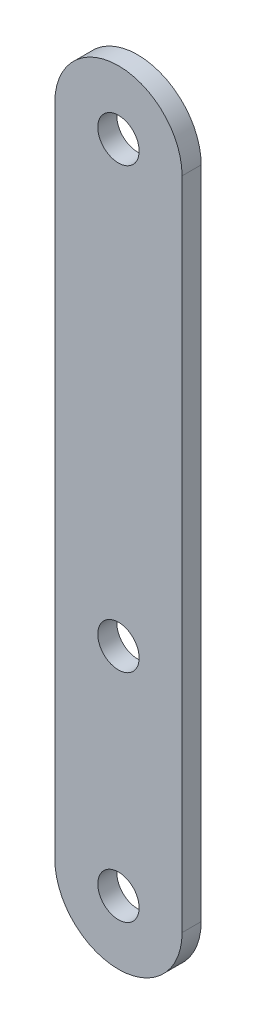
ISO-10303-21;
HEADER;
FILE_DESCRIPTION(('STEP AP214'),'2;1');
FILE_NAME('part.step','',(''),(''),'','','');
FILE_SCHEMA(('AUTOMOTIVE_DESIGN { 1 0 10303 214 1 1 1 1 }'));
ENDSEC;
DATA;
#1=APPLICATION_CONTEXT('core data for automotive mechanical design processes');
#2=APPLICATION_PROTOCOL_DEFINITION('international standard','automotive_design',2000,#1);
#3=PRODUCT_CONTEXT('',#1,'mechanical');
#4=PRODUCT('Part','Part','',(#3));
#5=PRODUCT_RELATED_PRODUCT_CATEGORY('part','',(#4));
#6=PRODUCT_DEFINITION_FORMATION('','',#4);
#7=PRODUCT_DEFINITION_CONTEXT('part definition',#1,'design');
#8=PRODUCT_DEFINITION('design','',#6,#7);
#9=PRODUCT_DEFINITION_SHAPE('','',#8);
#10=(LENGTH_UNIT() NAMED_UNIT(*) SI_UNIT(.MILLI.,.METRE.));
#11=(NAMED_UNIT(*) PLANE_ANGLE_UNIT() SI_UNIT($,.RADIAN.));
#12=(NAMED_UNIT(*) SI_UNIT($,.STERADIAN.) SOLID_ANGLE_UNIT());
#13=UNCERTAINTY_MEASURE_WITH_UNIT(LENGTH_MEASURE(1.E-05),#10,'distance_accuracy_value','');
#14=(GEOMETRIC_REPRESENTATION_CONTEXT(3) GLOBAL_UNCERTAINTY_ASSIGNED_CONTEXT((#13)) GLOBAL_UNIT_ASSIGNED_CONTEXT((#10,
#11,#12)) REPRESENTATION_CONTEXT('',''));
#15=CARTESIAN_POINT('',(0.,0.,0.));
#16=DIRECTION('',(0.,0.,1.));
#17=DIRECTION('',(1.,0.,0.));
#18=AXIS2_PLACEMENT_3D('',#15,#16,#17);
#19=CARTESIAN_POINT('',(0.,0.,3.));
#20=DIRECTION('',(0.,0.,-1.));
#21=DIRECTION('',(-1.,0.,0.));
#22=AXIS2_PLACEMENT_3D('',#19,#20,#21);
#23=PLANE('',#22);
#24=CARTESIAN_POINT('',(0.,0.,3.));
#25=DIRECTION('',(0.,0.,1.));
#26=DIRECTION('',(1.,0.,0.));
#27=AXIS2_PLACEMENT_3D('',#24,#25,#26);
#28=CIRCLE('',#27,3.25);
#29=CARTESIAN_POINT('',(3.25,0.,3.));
#30=VERTEX_POINT('',#29);
#31=EDGE_CURVE('E112',#30,#30,#28,.T.);
#32=ORIENTED_EDGE('',*,*,#31,.F.);
#33=EDGE_LOOP('',(#32));
#34=FACE_BOUND('',#33,.T.);
#35=CARTESIAN_POINT('',(0.,0.,3.));
#36=DIRECTION('',(0.,0.,1.));
#37=DIRECTION('',(-1.,0.,0.));
#38=AXIS2_PLACEMENT_3D('',#35,#36,#37);
#39=CIRCLE('',#38,10.);
#40=CARTESIAN_POINT('',(-10.,0.,3.));
#41=VERTEX_POINT('',#40);
#42=CARTESIAN_POINT('',(10.,0.,3.));
#43=VERTEX_POINT('',#42);
#44=EDGE_CURVE('E82',#41,#43,#39,.T.);
#45=ORIENTED_EDGE('',*,*,#44,.T.);
#46=DIRECTION('',(0.,1.,0.));
#47=VECTOR('',#46,1.);
#48=CARTESIAN_POINT('',(10.,0.,3.));
#49=LINE('',#48,#47);
#50=CARTESIAN_POINT('',(10.,103.,3.));
#51=VERTEX_POINT('',#50);
#52=EDGE_CURVE('E77',#43,#51,#49,.T.);
#53=ORIENTED_EDGE('',*,*,#52,.T.);
#54=CARTESIAN_POINT('',(0.,103.,3.));
#55=DIRECTION('',(0.,0.,1.));
#56=DIRECTION('',(1.,0.,0.));
#57=AXIS2_PLACEMENT_3D('',#54,#55,#56);
#58=CIRCLE('',#57,10.);
#59=CARTESIAN_POINT('',(-10.,103.,3.));
#60=VERTEX_POINT('',#59);
#61=EDGE_CURVE('E80',#51,#60,#58,.T.);
#62=ORIENTED_EDGE('',*,*,#61,.T.);
#63=DIRECTION('',(0.,-1.,0.));
#64=VECTOR('',#63,1.);
#65=CARTESIAN_POINT('',(-10.,0.,3.));
#66=LINE('',#65,#64);
#67=EDGE_CURVE('E47',#60,#41,#66,.T.);
#68=ORIENTED_EDGE('',*,*,#67,.T.);
#69=EDGE_LOOP('',(#45,#53,#62,#68));
#70=FACE_BOUND('',#69,.T.);
#71=CARTESIAN_POINT('',(0.,103.,3.));
#72=DIRECTION('',(0.,0.,1.));
#73=DIRECTION('',(1.,0.,0.));
#74=AXIS2_PLACEMENT_3D('',#71,#72,#73);
#75=CIRCLE('',#74,3.25);
#76=CARTESIAN_POINT('',(3.25,103.,3.));
#77=VERTEX_POINT('',#76);
#78=EDGE_CURVE('E97',#77,#77,#75,.T.);
#79=ORIENTED_EDGE('',*,*,#78,.F.);
#80=EDGE_LOOP('',(#79));
#81=FACE_BOUND('',#80,.T.);
#82=CARTESIAN_POINT('',(0.,34.,3.));
#83=DIRECTION('',(0.,0.,1.));
#84=DIRECTION('',(1.,0.,0.));
#85=AXIS2_PLACEMENT_3D('',#82,#83,#84);
#86=CIRCLE('',#85,3.25);
#87=CARTESIAN_POINT('',(3.25,34.,3.));
#88=VERTEX_POINT('',#87);
#89=EDGE_CURVE('E118',#88,#88,#86,.T.);
#90=ORIENTED_EDGE('',*,*,#89,.F.);
#91=EDGE_LOOP('',(#90));
#92=FACE_BOUND('',#91,.T.);
#93=ADVANCED_FACE('F30',(#34,#70,#81,#92),#23,.F.);
#94=CARTESIAN_POINT('',(0.,0.,0.));
#95=DIRECTION('',(0.,0.,-1.));
#96=DIRECTION('',(-1.,0.,0.));
#97=AXIS2_PLACEMENT_3D('',#94,#95,#96);
#98=PLANE('',#97);
#99=CARTESIAN_POINT('',(0.,0.,0.));
#100=DIRECTION('',(0.,0.,1.));
#101=DIRECTION('',(1.,0.,0.));
#102=AXIS2_PLACEMENT_3D('',#99,#100,#101);
#103=CIRCLE('',#102,3.25);
#104=CARTESIAN_POINT('',(3.25,0.,0.));
#105=VERTEX_POINT('',#104);
#106=EDGE_CURVE('E115',#105,#105,#103,.T.);
#107=ORIENTED_EDGE('',*,*,#106,.T.);
#108=EDGE_LOOP('',(#107));
#109=FACE_BOUND('',#108,.T.);
#110=CARTESIAN_POINT('',(0.,0.,0.));
#111=DIRECTION('',(0.,0.,1.));
#112=DIRECTION('',(-1.,0.,0.));
#113=AXIS2_PLACEMENT_3D('',#110,#111,#112);
#114=CIRCLE('',#113,10.);
#115=CARTESIAN_POINT('',(-10.,0.,0.));
#116=VERTEX_POINT('',#115);
#117=CARTESIAN_POINT('',(10.,0.,0.));
#118=VERTEX_POINT('',#117);
#119=EDGE_CURVE('E94',#116,#118,#114,.T.);
#120=ORIENTED_EDGE('',*,*,#119,.F.);
#121=DIRECTION('',(0.,-1.,0.));
#122=VECTOR('',#121,1.);
#123=CARTESIAN_POINT('',(-10.,0.,0.));
#124=LINE('',#123,#122);
#125=CARTESIAN_POINT('',(-10.,103.,0.));
#126=VERTEX_POINT('',#125);
#127=EDGE_CURVE('E70',#126,#116,#124,.T.);
#128=ORIENTED_EDGE('',*,*,#127,.F.);
#129=CARTESIAN_POINT('',(0.,103.,0.));
#130=DIRECTION('',(0.,0.,1.));
#131=DIRECTION('',(1.,0.,0.));
#132=AXIS2_PLACEMENT_3D('',#129,#130,#131);
#133=CIRCLE('',#132,10.);
#134=CARTESIAN_POINT('',(10.,103.,0.));
#135=VERTEX_POINT('',#134);
#136=EDGE_CURVE('E64',#135,#126,#133,.T.);
#137=ORIENTED_EDGE('',*,*,#136,.F.);
#138=DIRECTION('',(0.,1.,0.));
#139=VECTOR('',#138,1.);
#140=CARTESIAN_POINT('',(10.,0.,0.));
#141=LINE('',#140,#139);
#142=EDGE_CURVE('E86',#118,#135,#141,.T.);
#143=ORIENTED_EDGE('',*,*,#142,.F.);
#144=EDGE_LOOP('',(#120,#128,#137,#143));
#145=FACE_BOUND('',#144,.T.);
#146=CARTESIAN_POINT('',(0.,103.,0.));
#147=DIRECTION('',(0.,0.,1.));
#148=DIRECTION('',(1.,0.,0.));
#149=AXIS2_PLACEMENT_3D('',#146,#147,#148);
#150=CIRCLE('',#149,3.25);
#151=CARTESIAN_POINT('',(3.25,103.,0.));
#152=VERTEX_POINT('',#151);
#153=EDGE_CURVE('E109',#152,#152,#150,.T.);
#154=ORIENTED_EDGE('',*,*,#153,.T.);
#155=EDGE_LOOP('',(#154));
#156=FACE_BOUND('',#155,.T.);
#157=CARTESIAN_POINT('',(0.,34.,0.));
#158=DIRECTION('',(0.,0.,1.));
#159=DIRECTION('',(1.,0.,0.));
#160=AXIS2_PLACEMENT_3D('',#157,#158,#159);
#161=CIRCLE('',#160,3.25);
#162=CARTESIAN_POINT('',(3.25,34.,0.));
#163=VERTEX_POINT('',#162);
#164=EDGE_CURVE('E121',#163,#163,#161,.T.);
#165=ORIENTED_EDGE('',*,*,#164,.T.);
#166=EDGE_LOOP('',(#165));
#167=FACE_BOUND('',#166,.T.);
#168=ADVANCED_FACE('F105',(#109,#145,#156,#167),#98,.T.);
#169=CARTESIAN_POINT('',(0.,0.,3.));
#170=DIRECTION('',(0.,0.,-1.));
#171=DIRECTION('',(-1.,0.,0.));
#172=AXIS2_PLACEMENT_3D('',#169,#170,#171);
#173=CYLINDRICAL_SURFACE('',#172,10.);
#174=ORIENTED_EDGE('',*,*,#119,.T.);
#175=DIRECTION('',(0.,0.,-1.));
#176=VECTOR('',#175,1.);
#177=CARTESIAN_POINT('',(10.,0.,3.));
#178=LINE('',#177,#176);
#179=EDGE_CURVE('E11',#43,#118,#178,.T.);
#180=ORIENTED_EDGE('',*,*,#179,.F.);
#181=ORIENTED_EDGE('',*,*,#44,.F.);
#182=DIRECTION('',(0.,0.,-1.));
#183=VECTOR('',#182,1.);
#184=CARTESIAN_POINT('',(-10.,0.,3.));
#185=LINE('',#184,#183);
#186=EDGE_CURVE('E90',#41,#116,#185,.T.);
#187=ORIENTED_EDGE('',*,*,#186,.T.);
#188=EDGE_LOOP('',(#174,#180,#181,#187));
#189=FACE_BOUND('',#188,.T.);
#190=ADVANCED_FACE('F32',(#189),#173,.T.);
#191=CARTESIAN_POINT('',(10.,0.,3.));
#192=DIRECTION('',(-1.,0.,0.));
#193=DIRECTION('',(0.,0.,1.));
#194=AXIS2_PLACEMENT_3D('',#191,#192,#193);
#195=PLANE('',#194);
#196=ORIENTED_EDGE('',*,*,#142,.T.);
#197=DIRECTION('',(0.,0.,-1.));
#198=VECTOR('',#197,1.);
#199=CARTESIAN_POINT('',(10.,103.,3.));
#200=LINE('',#199,#198);
#201=EDGE_CURVE('E39',#51,#135,#200,.T.);
#202=ORIENTED_EDGE('',*,*,#201,.F.);
#203=ORIENTED_EDGE('',*,*,#52,.F.);
#204=ORIENTED_EDGE('',*,*,#179,.T.);
#205=EDGE_LOOP('',(#196,#202,#203,#204));
#206=FACE_BOUND('',#205,.T.);
#207=ADVANCED_FACE('F85',(#206),#195,.F.);
#208=CARTESIAN_POINT('',(0.,103.,3.));
#209=DIRECTION('',(0.,0.,-1.));
#210=DIRECTION('',(-1.,0.,0.));
#211=AXIS2_PLACEMENT_3D('',#208,#209,#210);
#212=CYLINDRICAL_SURFACE('',#211,10.);
#213=ORIENTED_EDGE('',*,*,#136,.T.);
#214=DIRECTION('',(0.,0.,-1.));
#215=VECTOR('',#214,1.);
#216=CARTESIAN_POINT('',(-10.,103.,3.));
#217=LINE('',#216,#215);
#218=EDGE_CURVE('E87',#60,#126,#217,.T.);
#219=ORIENTED_EDGE('',*,*,#218,.F.);
#220=ORIENTED_EDGE('',*,*,#61,.F.);
#221=ORIENTED_EDGE('',*,*,#201,.T.);
#222=EDGE_LOOP('',(#213,#219,#220,#221));
#223=FACE_BOUND('',#222,.T.);
#224=ADVANCED_FACE('F88',(#223),#212,.T.);
#225=CARTESIAN_POINT('',(-10.,0.,3.));
#226=DIRECTION('',(1.,0.,0.));
#227=DIRECTION('',(0.,0.,-1.));
#228=AXIS2_PLACEMENT_3D('',#225,#226,#227);
#229=PLANE('',#228);
#230=ORIENTED_EDGE('',*,*,#127,.T.);
#231=ORIENTED_EDGE('',*,*,#186,.F.);
#232=ORIENTED_EDGE('',*,*,#67,.F.);
#233=ORIENTED_EDGE('',*,*,#218,.T.);
#234=EDGE_LOOP('',(#230,#231,#232,#233));
#235=FACE_BOUND('',#234,.T.);
#236=ADVANCED_FACE('F102',(#235),#229,.F.);
#237=CARTESIAN_POINT('',(0.,103.,3.));
#238=DIRECTION('',(0.,0.,-1.));
#239=DIRECTION('',(-1.,0.,0.));
#240=AXIS2_PLACEMENT_3D('',#237,#238,#239);
#241=CYLINDRICAL_SURFACE('',#240,3.25);
#242=ORIENTED_EDGE('',*,*,#78,.T.);
#243=EDGE_LOOP('',(#242));
#244=FACE_BOUND('',#243,.T.);
#245=ORIENTED_EDGE('',*,*,#153,.F.);
#246=EDGE_LOOP('',(#245));
#247=FACE_BOUND('',#246,.T.);
#248=ADVANCED_FACE('F140',(#244,#247),#241,.F.);
#249=CARTESIAN_POINT('',(0.,0.,3.));
#250=DIRECTION('',(0.,0.,-1.));
#251=DIRECTION('',(-1.,0.,0.));
#252=AXIS2_PLACEMENT_3D('',#249,#250,#251);
#253=CYLINDRICAL_SURFACE('',#252,3.25);
#254=ORIENTED_EDGE('',*,*,#31,.T.);
#255=EDGE_LOOP('',(#254));
#256=FACE_BOUND('',#255,.T.);
#257=ORIENTED_EDGE('',*,*,#106,.F.);
#258=EDGE_LOOP('',(#257));
#259=FACE_BOUND('',#258,.T.);
#260=ADVANCED_FACE('F186',(#256,#259),#253,.F.);
#261=CARTESIAN_POINT('',(0.,34.,3.));
#262=DIRECTION('',(0.,0.,-1.));
#263=DIRECTION('',(-1.,0.,0.));
#264=AXIS2_PLACEMENT_3D('',#261,#262,#263);
#265=CYLINDRICAL_SURFACE('',#264,3.25);
#266=ORIENTED_EDGE('',*,*,#89,.T.);
#267=EDGE_LOOP('',(#266));
#268=FACE_BOUND('',#267,.T.);
#269=ORIENTED_EDGE('',*,*,#164,.F.);
#270=EDGE_LOOP('',(#269));
#271=FACE_BOUND('',#270,.T.);
#272=ADVANCED_FACE('F127',(#268,#271),#265,.F.);
#273=CLOSED_SHELL('',(#93,#168,#190,#207,#224,#236,#248,#260,#272));
#274=MANIFOLD_SOLID_BREP('B2',#273);
#275=ADVANCED_BREP_SHAPE_REPRESENTATION('',(#18,#274),#14);
#276=SHAPE_DEFINITION_REPRESENTATION(#9,#275);
ENDSEC;
END-ISO-10303-21;
